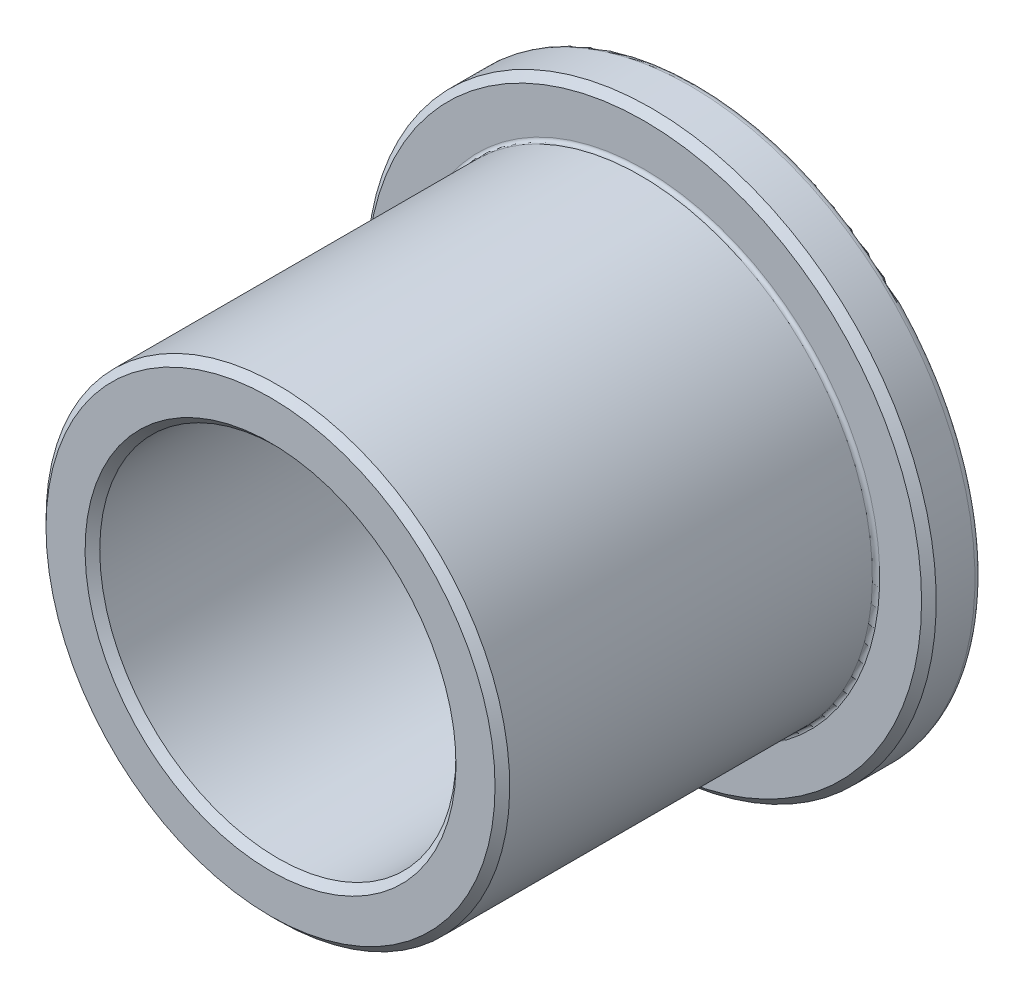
from build123d import *

# Parameters (mm, degrees)
CHAMFER1_SIZE = 0.20625
FILLET1_R     = 0.20625
FILLET2_R     = 0.103125


with BuildPart() as part:
    # Sketch3 → Revolve1 (revolve)
    with BuildSketch(Plane(origin=(0, 0, 0), x_dir=(0, 0, -1), z_dir=(1, 0, 0))):
        Polygon((6, 8), (4.5, 8), (4.5, 6.515), (-6, 6.515), (-6, 5.005), (6, 5.005), align=None)
    revolve(axis=Axis((0, 0, -6), (0, 0, 1)))

    # Chamfer1
    chamfer1_edges = [part.edges().sort_by_distance(p)[0] for p in [
        (0, -5.005, 6),
        (0, -6.515, 6),
        (0, -8, -4.5),
    ]]
    chamfer(chamfer1_edges, length=CHAMFER1_SIZE)

    # Fillet1
    fillet1_edges = [part.edges().sort_by_distance(p)[0] for p in [
        (0, -8, -6),
    ]]
    fillet(fillet1_edges, radius=FILLET1_R)

    # Fillet2
    fillet2_edges = [part.edges().sort_by_distance(p)[0] for p in [
        (0, -6.515, -4.5),
    ]]
    fillet(fillet2_edges, radius=FILLET2_R)


solid = part.part
